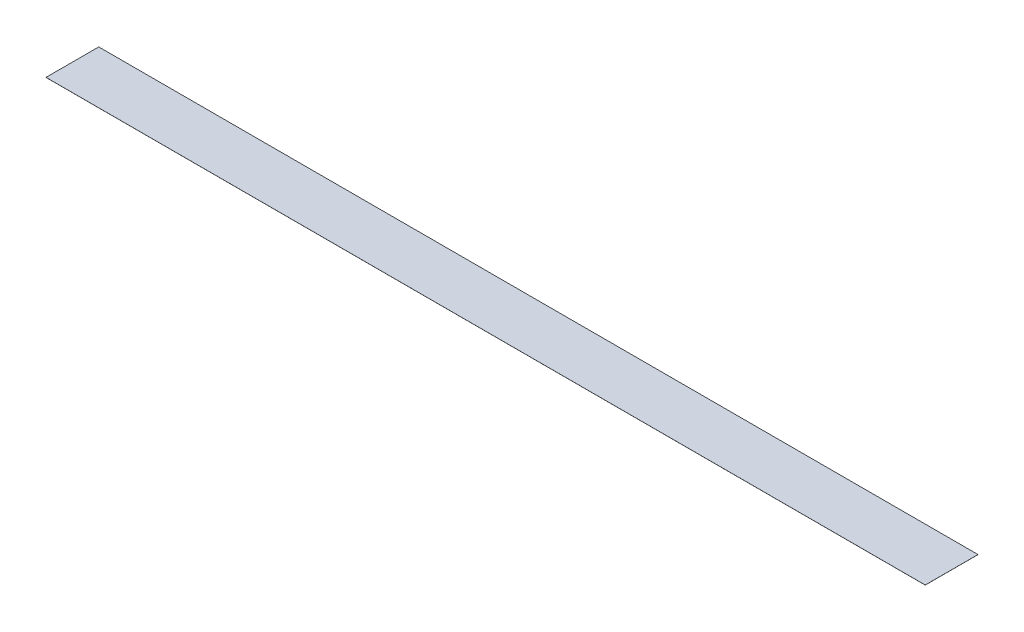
ISO-10303-21;
HEADER;
FILE_DESCRIPTION(('STEP AP214'),'2;1');
FILE_NAME('part.step','',(''),(''),'','','');
FILE_SCHEMA(('AUTOMOTIVE_DESIGN { 1 0 10303 214 1 1 1 1 }'));
ENDSEC;
DATA;
#1=APPLICATION_CONTEXT('core data for automotive mechanical design processes');
#2=APPLICATION_PROTOCOL_DEFINITION('international standard','automotive_design',2000,#1);
#3=PRODUCT_CONTEXT('',#1,'mechanical');
#4=PRODUCT('Part','Part','',(#3));
#5=PRODUCT_RELATED_PRODUCT_CATEGORY('part','',(#4));
#6=PRODUCT_DEFINITION_FORMATION('','',#4);
#7=PRODUCT_DEFINITION_CONTEXT('part definition',#1,'design');
#8=PRODUCT_DEFINITION('design','',#6,#7);
#9=PRODUCT_DEFINITION_SHAPE('','',#8);
#10=(LENGTH_UNIT() NAMED_UNIT(*) SI_UNIT(.MILLI.,.METRE.));
#11=(NAMED_UNIT(*) PLANE_ANGLE_UNIT() SI_UNIT($,.RADIAN.));
#12=(NAMED_UNIT(*) SI_UNIT($,.STERADIAN.) SOLID_ANGLE_UNIT());
#13=UNCERTAINTY_MEASURE_WITH_UNIT(LENGTH_MEASURE(1.E-05),#10,'distance_accuracy_value','');
#14=(GEOMETRIC_REPRESENTATION_CONTEXT(3) GLOBAL_UNCERTAINTY_ASSIGNED_CONTEXT((#13)) GLOBAL_UNIT_ASSIGNED_CONTEXT((#10,
#11,#12)) REPRESENTATION_CONTEXT('',''));
#15=CARTESIAN_POINT('',(0.,0.,0.));
#16=DIRECTION('',(0.,0.,1.));
#17=DIRECTION('',(1.,0.,0.));
#18=AXIS2_PLACEMENT_3D('',#15,#16,#17);
#19=CARTESIAN_POINT('',(0.,-1.,381.));
#20=DIRECTION('',(-1.,0.,0.));
#21=DIRECTION('',(0.,0.,1.));
#22=AXIS2_PLACEMENT_3D('',#19,#20,#21);
#23=PLANE('',#22);
#24=DIRECTION('',(0.,0.,1.));
#25=VECTOR('',#24,1.);
#26=CARTESIAN_POINT('',(0.,0.,381.));
#27=LINE('',#26,#25);
#28=CARTESIAN_POINT('',(0.,0.,-381.));
#29=VERTEX_POINT('',#28);
#30=CARTESIAN_POINT('',(0.,0.,381.));
#31=VERTEX_POINT('',#30);
#32=EDGE_CURVE('E97',#29,#31,#27,.T.);
#33=ORIENTED_EDGE('',*,*,#32,.F.);
#34=DIRECTION('',(0.,1.,0.));
#35=VECTOR('',#34,1.);
#36=CARTESIAN_POINT('',(0.,-1.,-381.));
#37=LINE('',#36,#35);
#38=CARTESIAN_POINT('',(0.,-1.,-381.));
#39=VERTEX_POINT('',#38);
#40=EDGE_CURVE('E11',#39,#29,#37,.T.);
#41=ORIENTED_EDGE('',*,*,#40,.F.);
#42=DIRECTION('',(0.,0.,1.));
#43=VECTOR('',#42,1.);
#44=CARTESIAN_POINT('',(0.,-1.,381.));
#45=LINE('',#44,#43);
#46=CARTESIAN_POINT('',(0.,-1.,381.));
#47=VERTEX_POINT('',#46);
#48=EDGE_CURVE('E91',#39,#47,#45,.T.);
#49=ORIENTED_EDGE('',*,*,#48,.T.);
#50=DIRECTION('',(0.,1.,0.));
#51=VECTOR('',#50,1.);
#52=CARTESIAN_POINT('',(0.,-1.,381.));
#53=LINE('',#52,#51);
#54=EDGE_CURVE('E36',#47,#31,#53,.T.);
#55=ORIENTED_EDGE('',*,*,#54,.T.);
#56=EDGE_LOOP('',(#33,#41,#49,#55));
#57=FACE_BOUND('',#56,.T.);
#58=ADVANCED_FACE('F33',(#57),#23,.T.);
#59=CARTESIAN_POINT('',(0.,-1.,-381.));
#60=DIRECTION('',(0.,0.,-1.));
#61=DIRECTION('',(-1.,0.,0.));
#62=AXIS2_PLACEMENT_3D('',#59,#60,#61);
#63=PLANE('',#62);
#64=DIRECTION('',(-1.,0.,0.));
#65=VECTOR('',#64,1.);
#66=CARTESIAN_POINT('',(0.,0.,-381.));
#67=LINE('',#66,#65);
#68=CARTESIAN_POINT('',(12700.,0.,-381.));
#69=VERTEX_POINT('',#68);
#70=EDGE_CURVE('E93',#69,#29,#67,.T.);
#71=ORIENTED_EDGE('',*,*,#70,.F.);
#72=DIRECTION('',(0.,1.,0.));
#73=VECTOR('',#72,1.);
#74=CARTESIAN_POINT('',(12700.,-1.,-381.));
#75=LINE('',#74,#73);
#76=CARTESIAN_POINT('',(12700.,-1.,-381.));
#77=VERTEX_POINT('',#76);
#78=EDGE_CURVE('E42',#77,#69,#75,.T.);
#79=ORIENTED_EDGE('',*,*,#78,.F.);
#80=DIRECTION('',(-1.,0.,0.));
#81=VECTOR('',#80,1.);
#82=CARTESIAN_POINT('',(0.,-1.,-381.));
#83=LINE('',#82,#81);
#84=EDGE_CURVE('E88',#77,#39,#83,.T.);
#85=ORIENTED_EDGE('',*,*,#84,.T.);
#86=ORIENTED_EDGE('',*,*,#40,.T.);
#87=EDGE_LOOP('',(#71,#79,#85,#86));
#88=FACE_BOUND('',#87,.T.);
#89=ADVANCED_FACE('F107',(#88),#63,.T.);
#90=CARTESIAN_POINT('',(12700.,-1.,381.));
#91=DIRECTION('',(1.,0.,0.));
#92=DIRECTION('',(0.,0.,-1.));
#93=AXIS2_PLACEMENT_3D('',#90,#91,#92);
#94=PLANE('',#93);
#95=DIRECTION('',(0.,0.,-1.));
#96=VECTOR('',#95,1.);
#97=CARTESIAN_POINT('',(12700.,0.,381.));
#98=LINE('',#97,#96);
#99=CARTESIAN_POINT('',(12700.,0.,381.));
#100=VERTEX_POINT('',#99);
#101=EDGE_CURVE('E83',#100,#69,#98,.T.);
#102=ORIENTED_EDGE('',*,*,#101,.F.);
#103=DIRECTION('',(0.,1.,0.));
#104=VECTOR('',#103,1.);
#105=CARTESIAN_POINT('',(12700.,-1.,381.));
#106=LINE('',#105,#104);
#107=CARTESIAN_POINT('',(12700.,-1.,381.));
#108=VERTEX_POINT('',#107);
#109=EDGE_CURVE('E78',#108,#100,#106,.T.);
#110=ORIENTED_EDGE('',*,*,#109,.F.);
#111=DIRECTION('',(0.,0.,-1.));
#112=VECTOR('',#111,1.);
#113=CARTESIAN_POINT('',(12700.,-1.,381.));
#114=LINE('',#113,#112);
#115=EDGE_CURVE('E81',#108,#77,#114,.T.);
#116=ORIENTED_EDGE('',*,*,#115,.T.);
#117=ORIENTED_EDGE('',*,*,#78,.T.);
#118=EDGE_LOOP('',(#102,#110,#116,#117));
#119=FACE_BOUND('',#118,.T.);
#120=ADVANCED_FACE('F80',(#119),#94,.T.);
#121=CARTESIAN_POINT('',(0.,-1.,381.));
#122=DIRECTION('',(0.,0.,1.));
#123=DIRECTION('',(1.,0.,0.));
#124=AXIS2_PLACEMENT_3D('',#121,#122,#123);
#125=PLANE('',#124);
#126=DIRECTION('',(1.,0.,0.));
#127=VECTOR('',#126,1.);
#128=CARTESIAN_POINT('',(0.,0.,381.));
#129=LINE('',#128,#127);
#130=EDGE_CURVE('E100',#31,#100,#129,.T.);
#131=ORIENTED_EDGE('',*,*,#130,.F.);
#132=ORIENTED_EDGE('',*,*,#54,.F.);
#133=DIRECTION('',(1.,0.,0.));
#134=VECTOR('',#133,1.);
#135=CARTESIAN_POINT('',(0.,-1.,381.));
#136=LINE('',#135,#134);
#137=EDGE_CURVE('E87',#47,#108,#136,.T.);
#138=ORIENTED_EDGE('',*,*,#137,.T.);
#139=ORIENTED_EDGE('',*,*,#109,.T.);
#140=EDGE_LOOP('',(#131,#132,#138,#139));
#141=FACE_BOUND('',#140,.T.);
#142=ADVANCED_FACE('F90',(#141),#125,.T.);
#143=CARTESIAN_POINT('',(0.,-1.,-381.));
#144=DIRECTION('',(0.,-1.,0.));
#145=DIRECTION('',(0.,0.,-1.));
#146=AXIS2_PLACEMENT_3D('',#143,#144,#145);
#147=PLANE('',#146);
#148=ORIENTED_EDGE('',*,*,#48,.F.);
#149=ORIENTED_EDGE('',*,*,#84,.F.);
#150=ORIENTED_EDGE('',*,*,#115,.F.);
#151=ORIENTED_EDGE('',*,*,#137,.F.);
#152=EDGE_LOOP('',(#148,#149,#150,#151));
#153=FACE_BOUND('',#152,.T.);
#154=ADVANCED_FACE('F86',(#153),#147,.T.);
#155=CARTESIAN_POINT('',(0.,0.,-381.));
#156=DIRECTION('',(0.,-1.,0.));
#157=DIRECTION('',(0.,0.,-1.));
#158=AXIS2_PLACEMENT_3D('',#155,#156,#157);
#159=PLANE('',#158);
#160=ORIENTED_EDGE('',*,*,#32,.T.);
#161=ORIENTED_EDGE('',*,*,#130,.T.);
#162=ORIENTED_EDGE('',*,*,#101,.T.);
#163=ORIENTED_EDGE('',*,*,#70,.T.);
#164=EDGE_LOOP('',(#160,#161,#162,#163));
#165=FACE_BOUND('',#164,.T.);
#166=ADVANCED_FACE('F106',(#165),#159,.F.);
#167=CLOSED_SHELL('',(#58,#89,#120,#142,#154,#166));
#168=MANIFOLD_SOLID_BREP('B2',#167);
#169=ADVANCED_BREP_SHAPE_REPRESENTATION('',(#18,#168),#14);
#170=SHAPE_DEFINITION_REPRESENTATION(#9,#169);
ENDSEC;
END-ISO-10303-21;
